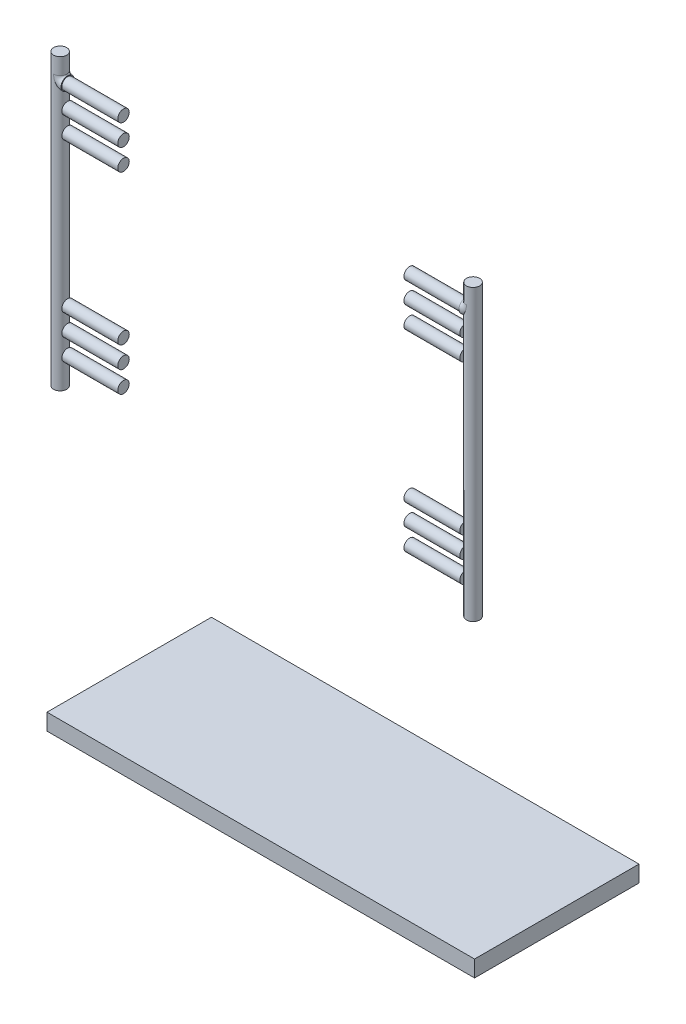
ISO-10303-21;
HEADER;
FILE_DESCRIPTION(('STEP AP214'),'2;1');
FILE_NAME('part.step','',(''),(''),'','','');
FILE_SCHEMA(('AUTOMOTIVE_DESIGN { 1 0 10303 214 1 1 1 1 }'));
ENDSEC;
DATA;
#1=APPLICATION_CONTEXT('core data for automotive mechanical design processes');
#2=APPLICATION_PROTOCOL_DEFINITION('international standard','automotive_design',2000,#1);
#3=PRODUCT_CONTEXT('',#1,'mechanical');
#4=PRODUCT('Part','Part','',(#3));
#5=PRODUCT_RELATED_PRODUCT_CATEGORY('part','',(#4));
#6=PRODUCT_DEFINITION_FORMATION('','',#4);
#7=PRODUCT_DEFINITION_CONTEXT('part definition',#1,'design');
#8=PRODUCT_DEFINITION('design','',#6,#7);
#9=PRODUCT_DEFINITION_SHAPE('','',#8);
#10=(LENGTH_UNIT() NAMED_UNIT(*) SI_UNIT(.MILLI.,.METRE.));
#11=(NAMED_UNIT(*) PLANE_ANGLE_UNIT() SI_UNIT($,.RADIAN.));
#12=(NAMED_UNIT(*) SI_UNIT($,.STERADIAN.) SOLID_ANGLE_UNIT());
#13=UNCERTAINTY_MEASURE_WITH_UNIT(LENGTH_MEASURE(1.E-05),#10,'distance_accuracy_value','');
#14=(GEOMETRIC_REPRESENTATION_CONTEXT(3) GLOBAL_UNCERTAINTY_ASSIGNED_CONTEXT((#13)) GLOBAL_UNIT_ASSIGNED_CONTEXT((#10,
#11,#12)) REPRESENTATION_CONTEXT('',''));
#15=CARTESIAN_POINT('',(0.,0.,0.));
#16=DIRECTION('',(0.,0.,1.));
#17=DIRECTION('',(1.,0.,0.));
#18=AXIS2_PLACEMENT_3D('',#15,#16,#17);
#19=CARTESIAN_POINT('',(-212.622773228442,-1002.37722677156,20.));
#20=DIRECTION('',(1.,0.,0.));
#21=DIRECTION('',(0.,1.,0.));
#22=AXIS2_PLACEMENT_3D('',#19,#20,#21);
#23=PLANE('',#22);
#24=DIRECTION('',(0.,0.,-1.));
#25=VECTOR('',#24,1.);
#26=CARTESIAN_POINT('',(-212.622773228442,-952.377226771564,20.));
#27=LINE('',#26,#25);
#28=CARTESIAN_POINT('',(-212.622773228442,-952.377226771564,20.));
#29=VERTEX_POINT('',#28);
#30=CARTESIAN_POINT('',(-212.622773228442,-952.377226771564,-480.));
#31=VERTEX_POINT('',#30);
#32=EDGE_CURVE('E107',#29,#31,#27,.T.);
#33=ORIENTED_EDGE('',*,*,#32,.T.);
#34=DIRECTION('',(0.,1.,0.));
#35=VECTOR('',#34,1.);
#36=CARTESIAN_POINT('',(-212.622773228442,-1002.37722677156,-480.));
#37=LINE('',#36,#35);
#38=CARTESIAN_POINT('',(-212.622773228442,-1002.37722677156,-480.));
#39=VERTEX_POINT('',#38);
#40=EDGE_CURVE('E12',#39,#31,#37,.T.);
#41=ORIENTED_EDGE('',*,*,#40,.F.);
#42=DIRECTION('',(0.,0.,-1.));
#43=VECTOR('',#42,1.);
#44=CARTESIAN_POINT('',(-212.622773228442,-1002.37722677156,20.));
#45=LINE('',#44,#43);
#46=CARTESIAN_POINT('',(-212.622773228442,-1002.37722677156,20.));
#47=VERTEX_POINT('',#46);
#48=EDGE_CURVE('E95',#47,#39,#45,.T.);
#49=ORIENTED_EDGE('',*,*,#48,.F.);
#50=DIRECTION('',(0.,1.,0.));
#51=VECTOR('',#50,1.);
#52=CARTESIAN_POINT('',(-212.622773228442,-1002.37722677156,20.));
#53=LINE('',#52,#51);
#54=EDGE_CURVE('E103',#47,#29,#53,.T.);
#55=ORIENTED_EDGE('',*,*,#54,.T.);
#56=EDGE_LOOP('',(#33,#41,#49,#55));
#57=FACE_BOUND('',#56,.T.);
#58=ADVANCED_FACE('F44',(#57),#23,.F.);
#59=CARTESIAN_POINT('',(-212.622773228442,-1002.37722677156,-480.));
#60=DIRECTION('',(0.,0.,1.));
#61=DIRECTION('',(1.,0.,0.));
#62=AXIS2_PLACEMENT_3D('',#59,#60,#61);
#63=PLANE('',#62);
#64=DIRECTION('',(1.,0.,0.));
#65=VECTOR('',#64,1.);
#66=CARTESIAN_POINT('',(-212.622773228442,-952.377226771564,-480.));
#67=LINE('',#66,#65);
#68=CARTESIAN_POINT('',(1087.37722677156,-952.377226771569,-480.));
#69=VERTEX_POINT('',#68);
#70=EDGE_CURVE('E99',#31,#69,#67,.T.);
#71=ORIENTED_EDGE('',*,*,#70,.T.);
#72=DIRECTION('',(0.,1.,0.));
#73=VECTOR('',#72,1.);
#74=CARTESIAN_POINT('',(1087.37722677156,-1002.37722677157,-480.));
#75=LINE('',#74,#73);
#76=CARTESIAN_POINT('',(1087.37722677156,-1002.37722677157,-480.));
#77=VERTEX_POINT('',#76);
#78=EDGE_CURVE('E52',#77,#69,#75,.T.);
#79=ORIENTED_EDGE('',*,*,#78,.F.);
#80=DIRECTION('',(1.,0.,0.));
#81=VECTOR('',#80,1.);
#82=CARTESIAN_POINT('',(-212.622773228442,-1002.37722677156,-480.));
#83=LINE('',#82,#81);
#84=EDGE_CURVE('E90',#39,#77,#83,.T.);
#85=ORIENTED_EDGE('',*,*,#84,.F.);
#86=ORIENTED_EDGE('',*,*,#40,.T.);
#87=EDGE_LOOP('',(#71,#79,#85,#86));
#88=FACE_BOUND('',#87,.T.);
#89=ADVANCED_FACE('F98',(#88),#63,.F.);
#90=CARTESIAN_POINT('',(1087.37722677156,-1002.37722677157,20.));
#91=DIRECTION('',(-1.,0.,0.));
#92=DIRECTION('',(0.,-1.,0.));
#93=AXIS2_PLACEMENT_3D('',#90,#91,#92);
#94=PLANE('',#93);
#95=DIRECTION('',(0.,0.,1.));
#96=VECTOR('',#95,1.);
#97=CARTESIAN_POINT('',(1087.37722677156,-952.377226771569,20.));
#98=LINE('',#97,#96);
#99=CARTESIAN_POINT('',(1087.37722677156,-952.377226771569,20.));
#100=VERTEX_POINT('',#99);
#101=EDGE_CURVE('E77',#69,#100,#98,.T.);
#102=ORIENTED_EDGE('',*,*,#101,.T.);
#103=DIRECTION('',(0.,1.,0.));
#104=VECTOR('',#103,1.);
#105=CARTESIAN_POINT('',(1087.37722677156,-1002.37722677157,20.));
#106=LINE('',#105,#104);
#107=CARTESIAN_POINT('',(1087.37722677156,-1002.37722677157,20.));
#108=VERTEX_POINT('',#107);
#109=EDGE_CURVE('E100',#108,#100,#106,.T.);
#110=ORIENTED_EDGE('',*,*,#109,.F.);
#111=DIRECTION('',(0.,0.,1.));
#112=VECTOR('',#111,1.);
#113=CARTESIAN_POINT('',(1087.37722677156,-1002.37722677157,20.));
#114=LINE('',#113,#112);
#115=EDGE_CURVE('E93',#77,#108,#114,.T.);
#116=ORIENTED_EDGE('',*,*,#115,.F.);
#117=ORIENTED_EDGE('',*,*,#78,.T.);
#118=EDGE_LOOP('',(#102,#110,#116,#117));
#119=FACE_BOUND('',#118,.T.);
#120=ADVANCED_FACE('F101',(#119),#94,.F.);
#121=CARTESIAN_POINT('',(-212.622773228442,-1002.37722677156,20.));
#122=DIRECTION('',(0.,0.,-1.));
#123=DIRECTION('',(-1.,0.,0.));
#124=AXIS2_PLACEMENT_3D('',#121,#122,#123);
#125=PLANE('',#124);
#126=DIRECTION('',(-1.,0.,0.));
#127=VECTOR('',#126,1.);
#128=CARTESIAN_POINT('',(-212.622773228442,-952.377226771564,20.));
#129=LINE('',#128,#127);
#130=EDGE_CURVE('E83',#100,#29,#129,.T.);
#131=ORIENTED_EDGE('',*,*,#130,.T.);
#132=ORIENTED_EDGE('',*,*,#54,.F.);
#133=DIRECTION('',(-1.,0.,0.));
#134=VECTOR('',#133,1.);
#135=CARTESIAN_POINT('',(-212.622773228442,-1002.37722677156,20.));
#136=LINE('',#135,#134);
#137=EDGE_CURVE('E60',#108,#47,#136,.T.);
#138=ORIENTED_EDGE('',*,*,#137,.F.);
#139=ORIENTED_EDGE('',*,*,#109,.T.);
#140=EDGE_LOOP('',(#131,#132,#138,#139));
#141=FACE_BOUND('',#140,.T.);
#142=ADVANCED_FACE('F114',(#141),#125,.F.);
#143=CARTESIAN_POINT('',(-3.49971820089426E-12,-1002.37722677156,0.));
#144=DIRECTION('',(0.,-1.,0.));
#145=DIRECTION('',(1.,0.,0.));
#146=AXIS2_PLACEMENT_3D('',#143,#144,#145);
#147=PLANE('',#146);
#148=ORIENTED_EDGE('',*,*,#48,.T.);
#149=ORIENTED_EDGE('',*,*,#84,.T.);
#150=ORIENTED_EDGE('',*,*,#115,.T.);
#151=ORIENTED_EDGE('',*,*,#137,.T.);
#152=EDGE_LOOP('',(#148,#149,#150,#151));
#153=FACE_BOUND('',#152,.T.);
#154=ADVANCED_FACE('F91',(#153),#147,.T.);
#155=CARTESIAN_POINT('',(-3.32514413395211E-12,-952.377226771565,0.));
#156=DIRECTION('',(0.,-1.,0.));
#157=DIRECTION('',(1.,0.,0.));
#158=AXIS2_PLACEMENT_3D('',#155,#156,#157);
#159=PLANE('',#158);
#160=ORIENTED_EDGE('',*,*,#32,.F.);
#161=ORIENTED_EDGE('',*,*,#130,.F.);
#162=ORIENTED_EDGE('',*,*,#101,.F.);
#163=ORIENTED_EDGE('',*,*,#70,.F.);
#164=EDGE_LOOP('',(#160,#161,#162,#163));
#165=FACE_BOUND('',#164,.T.);
#166=ADVANCED_FACE('F117',(#165),#159,.F.);
#167=CLOSED_SHELL('',(#58,#89,#120,#142,#154,#166));
#168=MANIFOLD_SOLID_BREP('B2',#167);
#169=CARTESIAN_POINT('',(1040.,735.,0.));
#170=DIRECTION('',(-1.,0.,0.));
#171=DIRECTION('',(0.,0.,1.));
#172=AXIS2_PLACEMENT_3D('',#169,#170,#171);
#173=CYLINDRICAL_SURFACE('',#172,17.5);
#174=CARTESIAN_POINT('',(1040.,735.,0.));
#175=DIRECTION('',(1.,0.,0.));
#176=DIRECTION('',(0.,0.,-1.));
#177=AXIS2_PLACEMENT_3D('',#174,#175,#176);
#178=CIRCLE('',#177,17.5);
#179=CARTESIAN_POINT('',(1040.,735.,-17.5));
#180=VERTEX_POINT('',#179);
#181=EDGE_CURVE('E42',#180,#180,#178,.T.);
#182=ORIENTED_EDGE('',*,*,#181,.F.);
#183=EDGE_LOOP('',(#182));
#184=FACE_BOUND('',#183,.T.);
#185=CARTESIAN_POINT('',(870.,735.,0.));
#186=DIRECTION('',(1.,0.,0.));
#187=DIRECTION('',(0.,0.,-1.));
#188=AXIS2_PLACEMENT_3D('',#185,#186,#187);
#189=CIRCLE('',#188,17.5);
#190=CARTESIAN_POINT('',(870.,735.,-17.5));
#191=VERTEX_POINT('',#190);
#192=EDGE_CURVE('E178',#191,#191,#189,.T.);
#193=ORIENTED_EDGE('',*,*,#192,.T.);
#194=EDGE_LOOP('',(#193));
#195=FACE_BOUND('',#194,.T.);
#196=ADVANCED_FACE('F175',(#184,#195),#173,.T.);
#197=CARTESIAN_POINT('',(870.,735.,0.));
#198=DIRECTION('',(1.,0.,0.));
#199=DIRECTION('',(0.,0.,-1.));
#200=AXIS2_PLACEMENT_3D('',#197,#198,#199);
#201=PLANE('',#200);
#202=ORIENTED_EDGE('',*,*,#192,.F.);
#203=EDGE_LOOP('',(#202));
#204=FACE_BOUND('',#203,.T.);
#205=ADVANCED_FACE('F220',(#204),#201,.F.);
#206=CARTESIAN_POINT('',(1040.,735.,0.));
#207=DIRECTION('',(1.,0.,0.));
#208=DIRECTION('',(0.,0.,-1.));
#209=AXIS2_PLACEMENT_3D('',#206,#207,#208);
#210=PLANE('',#209);
#211=CARTESIAN_POINT('',(1040.,735.,0.));
#212=DIRECTION('',(1.,0.,0.));
#213=DIRECTION('',(0.,0.,-1.));
#214=AXIS2_PLACEMENT_3D('',#211,#212,#213);
#215=CIRCLE('',#214,20.);
#216=CARTESIAN_POINT('',(1040.,735.,-20.));
#217=VERTEX_POINT('',#216);
#218=EDGE_CURVE('E194',#217,#217,#215,.T.);
#219=ORIENTED_EDGE('',*,*,#218,.F.);
#220=EDGE_LOOP('',(#219));
#221=FACE_BOUND('',#220,.T.);
#222=ORIENTED_EDGE('',*,*,#181,.T.);
#223=EDGE_LOOP('',(#222));
#224=FACE_BOUND('',#223,.T.);
#225=ADVANCED_FACE('F218',(#221,#224),#210,.F.);
#226=CARTESIAN_POINT('',(1040.,757.755617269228,0.));
#227=DIRECTION('',(0.,0.,-1.));
#228=DIRECTION('',(-1.,0.,0.));
#229=AXIS2_PLACEMENT_3D('',#226,#227,#228);
#230=TOROIDAL_SURFACE('',#229,22.755617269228,20.);
#231=CARTESIAN_POINT('',(1062.75561726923,757.755617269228,0.));
#232=DIRECTION('',(0.,1.,0.));
#233=DIRECTION('',(0.,0.,-1.));
#234=AXIS2_PLACEMENT_3D('',#231,#232,#233);
#235=CIRCLE('',#234,20.);
#236=CARTESIAN_POINT('',(1062.75561726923,757.755617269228,-20.));
#237=VERTEX_POINT('',#236);
#238=CARTESIAN_POINT('',(1062.75561726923,757.755617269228,20.));
#239=VERTEX_POINT('',#238);
#240=EDGE_CURVE('E188',#237,#239,#235,.T.);
#241=ORIENTED_EDGE('',*,*,#240,.F.);
#242=CARTESIAN_POINT('',(1062.75561726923,757.755617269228,-20.));
#243=CARTESIAN_POINT('',(1062.75561726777,757.684505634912,-20.0000000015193));
#244=CARTESIAN_POINT('',(1062.75545059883,757.613394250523,-20.0000000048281));
#245=CARTESIAN_POINT('',(1062.75479714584,757.473989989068,-19.9999999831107));
#246=CARTESIAN_POINT('',(1062.75432330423,757.405697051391,-19.9999999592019));
#247=CARTESIAN_POINT('',(1062.75118544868,757.064227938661,-19.999999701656));
#248=CARTESIAN_POINT('',(1062.74621559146,756.791069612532,-19.999999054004));
#249=CARTESIAN_POINT('',(1062.72959863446,756.180028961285,-19.9999853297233));
#250=CARTESIAN_POINT('',(1062.71664609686,755.842181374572,-19.9999693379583));
#251=CARTESIAN_POINT('',(1062.6854365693,755.211194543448,-19.9998818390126));
#252=CARTESIAN_POINT('',(1062.66809915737,754.918008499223,-19.9998178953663));
#253=CARTESIAN_POINT('',(1062.60760267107,754.038569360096,-19.9994945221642));
#254=CARTESIAN_POINT('',(1062.55597239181,753.452866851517,-19.9991034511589));
#255=CARTESIAN_POINT('',(1062.46182209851,752.57609414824,-19.9978659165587));
#256=CARTESIAN_POINT('',(1062.42764886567,752.284094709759,-19.9973448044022));
#257=CARTESIAN_POINT('',(1062.35378106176,751.700768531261,-19.9959969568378));
#258=CARTESIAN_POINT('',(1062.31408601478,751.409441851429,-19.995170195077));
#259=CARTESIAN_POINT('',(1062.18584859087,750.530114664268,-19.992067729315));
#260=CARTESIAN_POINT('',(1062.08885883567,749.943326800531,-19.9891748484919));
#261=CARTESIAN_POINT('',(1061.87306681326,748.773746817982,-19.9808094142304));
#262=CARTESIAN_POINT('',(1061.75426202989,748.190955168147,-19.9753365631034));
#263=CARTESIAN_POINT('',(1061.49544481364,747.029895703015,-19.9606809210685));
#264=CARTESIAN_POINT('',(1061.35542396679,746.451629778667,-19.9514966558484));
#265=CARTESIAN_POINT('',(1061.05495946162,745.300517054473,-19.9281312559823));
#266=CARTESIAN_POINT('',(1060.89451422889,744.727670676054,-19.9139497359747));
#267=CARTESIAN_POINT('',(1060.38272557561,743.014788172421,-19.86171258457));
#268=CARTESIAN_POINT('',(1060.00168183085,741.883753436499,-19.8139906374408));
#269=CARTESIAN_POINT('',(1059.16822762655,739.650928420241,-19.680155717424));
#270=CARTESIAN_POINT('',(1058.7158286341,738.549133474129,-19.5940489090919));
#271=CARTESIAN_POINT('',(1057.74612326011,736.374219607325,-19.3688884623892));
#272=CARTESIAN_POINT('',(1057.22854547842,735.301244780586,-19.2296081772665));
#273=CARTESIAN_POINT('',(1056.13976009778,733.19341021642,-18.8827162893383));
#274=CARTESIAN_POINT('',(1055.56853716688,732.158561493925,-18.6750851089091));
#275=CARTESIAN_POINT('',(1054.68181975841,730.641931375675,-18.3007141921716));
#276=CARTESIAN_POINT('',(1054.38177136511,730.143099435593,-18.165702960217));
#277=CARTESIAN_POINT('',(1053.77310881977,729.157491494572,-17.8725678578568));
#278=CARTESIAN_POINT('',(1053.46449423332,728.670716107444,-17.7144428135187));
#279=CARTESIAN_POINT('',(1052.84090202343,727.710782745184,-17.3731016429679));
#280=CARTESIAN_POINT('',(1052.52592965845,727.237614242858,-17.1899055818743));
#281=CARTESIAN_POINT('',(1051.89157684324,726.305834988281,-16.7961891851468));
#282=CARTESIAN_POINT('',(1051.57219671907,725.847223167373,-16.5856708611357));
#283=CARTESIAN_POINT('',(1050.90950237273,724.915178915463,-16.1196990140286));
#284=CARTESIAN_POINT('',(1050.56604801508,724.442884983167,-15.8621546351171));
#285=CARTESIAN_POINT('',(1049.88038487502,723.518958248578,-15.3108419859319));
#286=CARTESIAN_POINT('',(1049.53817599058,723.067323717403,-15.0170767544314));
#287=CARTESIAN_POINT('',(1048.85914230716,722.187585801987,-14.3910096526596));
#288=CARTESIAN_POINT('',(1048.52231531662,721.759472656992,-14.0587239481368));
#289=CARTESIAN_POINT('',(1047.85859760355,720.92987233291,-13.3533967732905));
#290=CARTESIAN_POINT('',(1047.53170525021,720.528380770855,-12.9803620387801));
#291=CARTESIAN_POINT('',(1046.95019093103,719.824762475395,-12.2622277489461));
#292=CARTESIAN_POINT('',(1046.69307381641,719.517681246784,-11.9240028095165));
#293=CARTESIAN_POINT('',(1046.19256995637,718.926545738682,-11.2184004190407));
#294=CARTESIAN_POINT('',(1045.94918287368,718.642490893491,-10.8510236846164));
#295=CARTESIAN_POINT('',(1045.48011641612,718.100451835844,-10.0874979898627));
#296=CARTESIAN_POINT('',(1045.25441976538,717.842442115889,-9.69137784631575));
#297=CARTESIAN_POINT('',(1044.82452124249,717.355221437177,-8.8707495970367));
#298=CARTESIAN_POINT('',(1044.62031483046,717.126004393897,-8.44624751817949));
#299=CARTESIAN_POINT('',(1044.27457831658,716.740749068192,-7.65505794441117));
#300=CARTESIAN_POINT('',(1044.12856067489,716.579127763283,-7.29304093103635));
#301=CARTESIAN_POINT('',(1043.85548176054,716.278399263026,-6.55289178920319));
#302=CARTESIAN_POINT('',(1043.72841667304,716.139287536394,-6.17476292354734));
#303=CARTESIAN_POINT('',(1043.49539853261,715.885236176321,-5.40424916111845));
#304=CARTESIAN_POINT('',(1043.3894391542,715.770289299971,-5.01186857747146));
#305=CARTESIAN_POINT('',(1043.20053820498,715.566021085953,-4.21503445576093));
#306=CARTESIAN_POINT('',(1043.1175969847,715.476700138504,-3.81058073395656));
#307=CARTESIAN_POINT('',(1042.97601728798,715.324568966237,-2.99024400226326));
#308=CARTESIAN_POINT('',(1042.91750864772,715.261900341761,-2.574312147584));
#309=CARTESIAN_POINT('',(1042.82667365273,715.164725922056,-1.73632078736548));
#310=CARTESIAN_POINT('',(1042.79434742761,715.130220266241,-1.31426125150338));
#311=CARTESIAN_POINT('',(1042.75659708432,715.089933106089,-0.467653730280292));
#312=CARTESIAN_POINT('',(1042.75116763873,715.084145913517,-0.0431062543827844));
#313=CARTESIAN_POINT('',(1042.76732109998,715.101377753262,0.80486960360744));
#314=CARTESIAN_POINT('',(1042.78890232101,715.124394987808,1.22829805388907));
#315=CARTESIAN_POINT('',(1042.85560248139,715.195664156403,2.03439294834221));
#316=CARTESIAN_POINT('',(1042.8985514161,715.24159051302,2.41744944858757));
#317=CARTESIAN_POINT('',(1043.00583840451,715.356596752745,3.17699882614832));
#318=CARTESIAN_POINT('',(1043.07017496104,715.425675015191,3.55349216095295));
#319=CARTESIAN_POINT('',(1043.21911936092,715.586117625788,4.29758455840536));
#320=CARTESIAN_POINT('',(1043.30372699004,715.677481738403,4.66518371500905));
#321=CARTESIAN_POINT('',(1043.49183206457,715.881428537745,5.38949041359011));
#322=CARTESIAN_POINT('',(1043.59533048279,715.99401231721,5.74619739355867));
#323=CARTESIAN_POINT('',(1043.82428192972,716.244255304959,6.46152783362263));
#324=CARTESIAN_POINT('',(1043.95046542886,716.382758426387,6.81962143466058));
#325=CARTESIAN_POINT('',(1044.21970422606,716.679996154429,7.52070190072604));
#326=CARTESIAN_POINT('',(1044.36275947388,716.838730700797,7.86368881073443));
#327=CARTESIAN_POINT('',(1044.66383931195,717.174999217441,8.53360834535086));
#328=CARTESIAN_POINT('',(1044.82186828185,717.352538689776,8.86053623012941));
#329=CARTESIAN_POINT('',(1045.15094218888,717.724932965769,9.49757954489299));
#330=CARTESIAN_POINT('',(1045.32198988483,717.919791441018,9.80769138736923));
#331=CARTESIAN_POINT('',(1045.76274335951,718.425918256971,10.5600749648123));
#332=CARTESIAN_POINT('',(1046.03935260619,718.747041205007,10.9917279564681));
#333=CARTESIAN_POINT('',(1046.61165014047,719.420551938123,11.8162786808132));
#334=CARTESIAN_POINT('',(1046.90734582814,719.772951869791,12.2091612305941));
#335=CARTESIAN_POINT('',(1047.51305008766,720.505777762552,12.9574784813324));
#336=CARTESIAN_POINT('',(1047.82308289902,720.88625188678,13.3128461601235));
#337=CARTESIAN_POINT('',(1048.45230437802,721.671312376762,13.9867002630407));
#338=CARTESIAN_POINT('',(1048.77149310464,722.075898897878,14.3051864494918));
#339=CARTESIAN_POINT('',(1049.55871963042,723.091881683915,15.041547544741));
#340=CARTESIAN_POINT('',(1050.02959463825,723.714970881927,15.44031936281));
#341=CARTESIAN_POINT('',(1050.9718389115,724.998919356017,16.1709073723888));
#342=CARTESIAN_POINT('',(1051.44320830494,725.659796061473,16.5026923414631));
#343=CARTESIAN_POINT('',(1052.37855196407,727.014673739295,17.106334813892));
#344=CARTESIAN_POINT('',(1052.84251549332,727.708717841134,17.3781115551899));
#345=CARTESIAN_POINT('',(1053.75537949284,729.124771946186,17.8679603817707));
#346=CARTESIAN_POINT('',(1054.20428150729,729.846779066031,18.0860379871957));
#347=CARTESIAN_POINT('',(1055.15445005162,731.438111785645,18.5077192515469));
#348=CARTESIAN_POINT('',(1055.65196070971,732.311921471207,18.7028405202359));
#349=CARTESIAN_POINT('',(1056.61088753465,734.089215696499,19.0394469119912));
#350=CARTESIAN_POINT('',(1057.07229646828,734.992706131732,19.1809213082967));
#351=CARTESIAN_POINT('',(1057.95184327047,736.825021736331,19.4198668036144));
#352=CARTESIAN_POINT('',(1058.37002275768,737.753821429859,19.5173805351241));
#353=CARTESIAN_POINT('',(1059.15767649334,739.634425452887,19.6778125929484));
#354=CARTESIAN_POINT('',(1059.5271625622,740.586224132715,19.740739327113));
#355=CARTESIAN_POINT('',(1060.23325112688,742.569003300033,19.8437086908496));
#356=CARTESIAN_POINT('',(1060.56648230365,743.601276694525,19.8821249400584));
#357=CARTESIAN_POINT('',(1061.01669582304,745.163859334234,19.9248267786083));
#358=CARTESIAN_POINT('',(1061.15846617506,745.686952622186,19.9365725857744));
#359=CARTESIAN_POINT('',(1061.42493497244,746.737548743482,19.9561309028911));
#360=CARTESIAN_POINT('',(1061.54963381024,747.265051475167,19.9639435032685));
#361=CARTESIAN_POINT('',(1061.80864528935,748.448453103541,19.9780837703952));
#362=CARTESIAN_POINT('',(1061.93832557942,749.105381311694,19.983630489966));
#363=CARTESIAN_POINT('',(1062.16986331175,750.424071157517,19.991755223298));
#364=CARTESIAN_POINT('',(1062.27172286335,751.085832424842,19.9943334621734));
#365=CARTESIAN_POINT('',(1062.46850153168,752.576977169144,19.998241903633));
#366=CARTESIAN_POINT('',(1062.55550579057,753.407428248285,19.9991071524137));
#367=CARTESIAN_POINT('',(1062.65891569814,754.74587119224,19.9998014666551));
#368=CARTESIAN_POINT('',(1062.68962550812,755.252801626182,19.9999036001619));
#369=CARTESIAN_POINT('',(1062.72493889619,756.058185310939,19.999980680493));
#370=CARTESIAN_POINT('',(1062.73508574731,756.35640010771,19.9999907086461));
#371=CARTESIAN_POINT('',(1062.7494571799,756.950502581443,20.0000003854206));
#372=CARTESIAN_POINT('',(1062.75373016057,757.246389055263,20.0000001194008));
#373=CARTESIAN_POINT('',(1062.75545062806,757.613394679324,19.9999999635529));
#374=CARTESIAN_POINT('',(1062.7556173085,757.684506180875,19.999999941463));
#375=CARTESIAN_POINT('',(1062.75561726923,757.755617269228,20.));
#376=B_SPLINE_CURVE_WITH_KNOTS('',3,(#242,#243,#244,#245,#246,#247,#248,#249,#250,#251,#252,
#253,#254,#255,#256,#257,#258,#259,#260,#261,#262,#263,#264,#265,#266,#267,#268,#269,#270,#271,
#272,#273,#274,#275,#276,#277,#278,#279,#280,#281,#282,#283,#284,#285,#286,#287,#288,#289,#290,
#291,#292,#293,#294,#295,#296,#297,#298,#299,#300,#301,#302,#303,#304,#305,#306,#307,#308,#309,
#310,#311,#312,#313,#314,#315,#316,#317,#318,#319,#320,#321,#322,#323,#324,#325,#326,#327,#328,
#329,#330,#331,#332,#333,#334,#335,#336,#337,#338,#339,#340,#341,#342,#343,#344,#345,#346,#347,
#348,#349,#350,#351,#352,#353,#354,#355,#356,#357,#358,#359,#360,#361,#362,#363,#364,#365,#366,
#367,#368,#369,#370,#371,#372,#373,#374,#375),.UNSPECIFIED.,.F.,.F.,(4,2,2,2,2,2,2,2,2,2,2,2,2,
2,2,2,2,2,2,2,2,2,2,2,2,2,2,2,2,2,2,2,2,2,2,2,2,2,2,2,2,2,2,2,2,2,2,2,2,2,2,2,2,2,2,2,2,2,2,2,2,
2,2,2,2,2,4),(0.,0.213334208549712,0.418217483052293,1.23778170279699,2.25197794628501,
3.13303285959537,4.89643724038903,5.77837403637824,6.66038689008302,8.44419231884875,
10.228203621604,12.0129242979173,13.7977826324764,17.3777604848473,20.9571636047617,
24.5519970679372,28.1478610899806,29.9400587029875,31.7323473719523,33.5232099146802,
35.3139406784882,37.2274032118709,39.1407053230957,41.0532073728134,42.9653937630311,
44.5367037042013,46.1079750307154,47.6776922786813,49.2470772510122,50.5133280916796,
51.7793237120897,53.0449393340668,54.3105742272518,55.5828517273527,56.8551355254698,
58.1271673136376,59.3991197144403,60.5623311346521,61.7254611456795,62.8885788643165,
64.0517564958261,65.2629977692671,66.4742354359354,67.6858284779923,68.8976789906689,
70.7097608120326,72.5225494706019,74.3385238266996,76.1545098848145,78.7811966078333,
81.4091048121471,84.040528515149,86.671681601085,89.7417329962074,92.8123979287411,
95.8800785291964,98.9470130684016,102.200659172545,103.826686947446,105.452677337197,
107.460944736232,109.4690598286,111.972695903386,113.496012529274,114.391121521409,
115.278809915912,115.492144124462),.UNSPECIFIED.);
#377=EDGE_CURVE('E190',#237,#239,#376,.T.);
#378=ORIENTED_EDGE('',*,*,#377,.T.);
#379=EDGE_LOOP('',(#241,#378));
#380=FACE_BOUND('',#379,.T.);
#381=ORIENTED_EDGE('',*,*,#218,.T.);
#382=EDGE_LOOP('',(#381));
#383=FACE_BOUND('',#382,.T.);
#384=ADVANCED_FACE('F191',(#380,#383),#230,.T.);
#385=CARTESIAN_POINT('',(1062.75561726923,-72.2443827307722,0.));
#386=DIRECTION('',(0.,1.,0.));
#387=DIRECTION('',(-1.,0.,0.));
#388=AXIS2_PLACEMENT_3D('',#385,#386,#387);
#389=CYLINDRICAL_SURFACE('',#388,20.);
#390=CARTESIAN_POINT('',(1062.75561726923,-72.2443827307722,0.));
#391=DIRECTION('',(0.,1.,0.));
#392=DIRECTION('',(-1.,0.,0.));
#393=AXIS2_PLACEMENT_3D('',#390,#391,#392);
#394=CIRCLE('',#393,20.);
#395=CARTESIAN_POINT('',(1042.75561726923,-72.2443827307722,0.));
#396=VERTEX_POINT('',#395);
#397=EDGE_CURVE('E195',#396,#396,#394,.T.);
#398=ORIENTED_EDGE('',*,*,#397,.T.);
#399=EDGE_LOOP('',(#398));
#400=FACE_BOUND('',#399,.T.);
#401=ORIENTED_EDGE('',*,*,#377,.F.);
#402=ORIENTED_EDGE('',*,*,#240,.T.);
#403=EDGE_LOOP('',(#401,#402));
#404=FACE_BOUND('',#403,.T.);
#405=CARTESIAN_POINT('',(1062.75561726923,807.755617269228,0.));
#406=DIRECTION('',(0.,1.,0.));
#407=DIRECTION('',(-1.,0.,0.));
#408=AXIS2_PLACEMENT_3D('',#405,#406,#407);
#409=CIRCLE('',#408,20.);
#410=CARTESIAN_POINT('',(1042.75561726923,807.755617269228,0.));
#411=VERTEX_POINT('',#410);
#412=EDGE_CURVE('E279',#411,#411,#409,.T.);
#413=ORIENTED_EDGE('',*,*,#412,.F.);
#414=EDGE_LOOP('',(#413));
#415=FACE_BOUND('',#414,.T.);
#416=ADVANCED_FACE('F197',(#400,#404,#415),#389,.T.);
#417=CARTESIAN_POINT('',(1062.75561726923,-72.2443827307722,0.));
#418=DIRECTION('',(0.,1.,0.));
#419=DIRECTION('',(-1.,0.,0.));
#420=AXIS2_PLACEMENT_3D('',#417,#418,#419);
#421=PLANE('',#420);
#422=ORIENTED_EDGE('',*,*,#397,.F.);
#423=EDGE_LOOP('',(#422));
#424=FACE_BOUND('',#423,.T.);
#425=ADVANCED_FACE('F215',(#424),#421,.F.);
#426=CARTESIAN_POINT('',(1062.75561726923,807.755617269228,0.));
#427=DIRECTION('',(0.,1.,0.));
#428=DIRECTION('',(-1.,0.,0.));
#429=AXIS2_PLACEMENT_3D('',#426,#427,#428);
#430=PLANE('',#429);
#431=ORIENTED_EDGE('',*,*,#412,.T.);
#432=EDGE_LOOP('',(#431));
#433=FACE_BOUND('',#432,.T.);
#434=ADVANCED_FACE('F265',(#433),#430,.T.);
#435=CLOSED_SHELL('',(#196,#205,#225,#384,#416,#425,#434));
#436=MANIFOLD_SOLID_BREP('B6',#435);
#437=CARTESIAN_POINT('',(1040.,670.,0.));
#438=DIRECTION('',(-1.,0.,0.));
#439=DIRECTION('',(0.,0.,1.));
#440=AXIS2_PLACEMENT_3D('',#437,#438,#439);
#441=CYLINDRICAL_SURFACE('',#440,17.5);
#442=CARTESIAN_POINT('',(1040.,670.,0.));
#443=DIRECTION('',(1.,0.,0.));
#444=DIRECTION('',(0.,0.,-1.));
#445=AXIS2_PLACEMENT_3D('',#442,#443,#444);
#446=CIRCLE('',#445,17.5);
#447=CARTESIAN_POINT('',(1040.,670.,-17.5));
#448=VERTEX_POINT('',#447);
#449=EDGE_CURVE('E174',#448,#448,#446,.T.);
#450=ORIENTED_EDGE('',*,*,#449,.F.);
#451=EDGE_LOOP('',(#450));
#452=FACE_BOUND('',#451,.T.);
#453=CARTESIAN_POINT('',(870.,670.,0.));
#454=DIRECTION('',(1.,0.,0.));
#455=DIRECTION('',(0.,0.,-1.));
#456=AXIS2_PLACEMENT_3D('',#453,#454,#455);
#457=CIRCLE('',#456,17.5);
#458=CARTESIAN_POINT('',(870.,670.,-17.5));
#459=VERTEX_POINT('',#458);
#460=EDGE_CURVE('E297',#459,#459,#457,.T.);
#461=ORIENTED_EDGE('',*,*,#460,.T.);
#462=EDGE_LOOP('',(#461));
#463=FACE_BOUND('',#462,.T.);
#464=ADVANCED_FACE('F294',(#452,#463),#441,.T.);
#465=CARTESIAN_POINT('',(1040.,670.,0.));
#466=DIRECTION('',(1.,0.,0.));
#467=DIRECTION('',(0.,0.,-1.));
#468=AXIS2_PLACEMENT_3D('',#465,#466,#467);
#469=PLANE('',#468);
#470=ORIENTED_EDGE('',*,*,#449,.T.);
#471=EDGE_LOOP('',(#470));
#472=FACE_BOUND('',#471,.T.);
#473=ADVANCED_FACE('F309',(#472),#469,.T.);
#474=CARTESIAN_POINT('',(870.,670.,0.));
#475=DIRECTION('',(1.,0.,0.));
#476=DIRECTION('',(0.,0.,-1.));
#477=AXIS2_PLACEMENT_3D('',#474,#475,#476);
#478=PLANE('',#477);
#479=ORIENTED_EDGE('',*,*,#460,.F.);
#480=EDGE_LOOP('',(#479));
#481=FACE_BOUND('',#480,.T.);
#482=ADVANCED_FACE('F307',(#481),#478,.F.);
#483=CLOSED_SHELL('',(#464,#473,#482));
#484=MANIFOLD_SOLID_BREP('B36',#483);
#485=CARTESIAN_POINT('',(1040.,605.,0.));
#486=DIRECTION('',(-1.,0.,0.));
#487=DIRECTION('',(0.,0.,1.));
#488=AXIS2_PLACEMENT_3D('',#485,#486,#487);
#489=CYLINDRICAL_SURFACE('',#488,17.5);
#490=CARTESIAN_POINT('',(1040.,605.,0.));
#491=DIRECTION('',(1.,0.,0.));
#492=DIRECTION('',(0.,0.,-1.));
#493=AXIS2_PLACEMENT_3D('',#490,#491,#492);
#494=CIRCLE('',#493,17.5);
#495=CARTESIAN_POINT('',(1040.,605.,-17.5));
#496=VERTEX_POINT('',#495);
#497=EDGE_CURVE('E293',#496,#496,#494,.T.);
#498=ORIENTED_EDGE('',*,*,#497,.F.);
#499=EDGE_LOOP('',(#498));
#500=FACE_BOUND('',#499,.T.);
#501=CARTESIAN_POINT('',(870.,605.,0.));
#502=DIRECTION('',(1.,0.,0.));
#503=DIRECTION('',(0.,0.,-1.));
#504=AXIS2_PLACEMENT_3D('',#501,#502,#503);
#505=CIRCLE('',#504,17.5);
#506=CARTESIAN_POINT('',(870.,605.,-17.5));
#507=VERTEX_POINT('',#506);
#508=EDGE_CURVE('E345',#507,#507,#505,.T.);
#509=ORIENTED_EDGE('',*,*,#508,.T.);
#510=EDGE_LOOP('',(#509));
#511=FACE_BOUND('',#510,.T.);
#512=ADVANCED_FACE('F342',(#500,#511),#489,.T.);
#513=CARTESIAN_POINT('',(1040.,605.,0.));
#514=DIRECTION('',(1.,0.,0.));
#515=DIRECTION('',(0.,0.,-1.));
#516=AXIS2_PLACEMENT_3D('',#513,#514,#515);
#517=PLANE('',#516);
#518=ORIENTED_EDGE('',*,*,#497,.T.);
#519=EDGE_LOOP('',(#518));
#520=FACE_BOUND('',#519,.T.);
#521=ADVANCED_FACE('F357',(#520),#517,.T.);
#522=CARTESIAN_POINT('',(870.,605.,0.));
#523=DIRECTION('',(1.,0.,0.));
#524=DIRECTION('',(0.,0.,-1.));
#525=AXIS2_PLACEMENT_3D('',#522,#523,#524);
#526=PLANE('',#525);
#527=ORIENTED_EDGE('',*,*,#508,.F.);
#528=EDGE_LOOP('',(#527));
#529=FACE_BOUND('',#528,.T.);
#530=ADVANCED_FACE('F355',(#529),#526,.F.);
#531=CLOSED_SHELL('',(#512,#521,#530));
#532=MANIFOLD_SOLID_BREP('B169',#531);
#533=CARTESIAN_POINT('',(1040.,150.,0.));
#534=DIRECTION('',(-1.,0.,0.));
#535=DIRECTION('',(0.,0.,1.));
#536=AXIS2_PLACEMENT_3D('',#533,#534,#535);
#537=CYLINDRICAL_SURFACE('',#536,17.5);
#538=CARTESIAN_POINT('',(1040.,150.,0.));
#539=DIRECTION('',(1.,0.,0.));
#540=DIRECTION('',(0.,0.,-1.));
#541=AXIS2_PLACEMENT_3D('',#538,#539,#540);
#542=CIRCLE('',#541,17.5);
#543=CARTESIAN_POINT('',(1040.,150.,-17.5));
#544=VERTEX_POINT('',#543);
#545=EDGE_CURVE('E341',#544,#544,#542,.T.);
#546=ORIENTED_EDGE('',*,*,#545,.F.);
#547=EDGE_LOOP('',(#546));
#548=FACE_BOUND('',#547,.T.);
#549=CARTESIAN_POINT('',(870.,150.,0.));
#550=DIRECTION('',(1.,0.,0.));
#551=DIRECTION('',(0.,0.,-1.));
#552=AXIS2_PLACEMENT_3D('',#549,#550,#551);
#553=CIRCLE('',#552,17.5);
#554=CARTESIAN_POINT('',(870.,150.,-17.5));
#555=VERTEX_POINT('',#554);
#556=EDGE_CURVE('E393',#555,#555,#553,.T.);
#557=ORIENTED_EDGE('',*,*,#556,.T.);
#558=EDGE_LOOP('',(#557));
#559=FACE_BOUND('',#558,.T.);
#560=ADVANCED_FACE('F390',(#548,#559),#537,.T.);
#561=CARTESIAN_POINT('',(1040.,150.,0.));
#562=DIRECTION('',(1.,0.,0.));
#563=DIRECTION('',(0.,0.,-1.));
#564=AXIS2_PLACEMENT_3D('',#561,#562,#563);
#565=PLANE('',#564);
#566=ORIENTED_EDGE('',*,*,#545,.T.);
#567=EDGE_LOOP('',(#566));
#568=FACE_BOUND('',#567,.T.);
#569=ADVANCED_FACE('F405',(#568),#565,.T.);
#570=CARTESIAN_POINT('',(870.,150.,0.));
#571=DIRECTION('',(1.,0.,0.));
#572=DIRECTION('',(0.,0.,-1.));
#573=AXIS2_PLACEMENT_3D('',#570,#571,#572);
#574=PLANE('',#573);
#575=ORIENTED_EDGE('',*,*,#556,.F.);
#576=EDGE_LOOP('',(#575));
#577=FACE_BOUND('',#576,.T.);
#578=ADVANCED_FACE('F403',(#577),#574,.F.);
#579=CLOSED_SHELL('',(#560,#569,#578));
#580=MANIFOLD_SOLID_BREP('B288',#579);
#581=CARTESIAN_POINT('',(1040.,85.,0.));
#582=DIRECTION('',(-1.,0.,0.));
#583=DIRECTION('',(0.,0.,1.));
#584=AXIS2_PLACEMENT_3D('',#581,#582,#583);
#585=CYLINDRICAL_SURFACE('',#584,17.5);
#586=CARTESIAN_POINT('',(1040.,85.,0.));
#587=DIRECTION('',(1.,0.,0.));
#588=DIRECTION('',(0.,0.,-1.));
#589=AXIS2_PLACEMENT_3D('',#586,#587,#588);
#590=CIRCLE('',#589,17.5);
#591=CARTESIAN_POINT('',(1040.,85.,-17.5));
#592=VERTEX_POINT('',#591);
#593=EDGE_CURVE('E389',#592,#592,#590,.T.);
#594=ORIENTED_EDGE('',*,*,#593,.F.);
#595=EDGE_LOOP('',(#594));
#596=FACE_BOUND('',#595,.T.);
#597=CARTESIAN_POINT('',(870.,85.,0.));
#598=DIRECTION('',(1.,0.,0.));
#599=DIRECTION('',(0.,0.,-1.));
#600=AXIS2_PLACEMENT_3D('',#597,#598,#599);
#601=CIRCLE('',#600,17.5);
#602=CARTESIAN_POINT('',(870.,85.,-17.5));
#603=VERTEX_POINT('',#602);
#604=EDGE_CURVE('E441',#603,#603,#601,.T.);
#605=ORIENTED_EDGE('',*,*,#604,.T.);
#606=EDGE_LOOP('',(#605));
#607=FACE_BOUND('',#606,.T.);
#608=ADVANCED_FACE('F438',(#596,#607),#585,.T.);
#609=CARTESIAN_POINT('',(1040.,85.,0.));
#610=DIRECTION('',(1.,0.,0.));
#611=DIRECTION('',(0.,0.,-1.));
#612=AXIS2_PLACEMENT_3D('',#609,#610,#611);
#613=PLANE('',#612);
#614=ORIENTED_EDGE('',*,*,#593,.T.);
#615=EDGE_LOOP('',(#614));
#616=FACE_BOUND('',#615,.T.);
#617=ADVANCED_FACE('F453',(#616),#613,.T.);
#618=CARTESIAN_POINT('',(870.,85.,0.));
#619=DIRECTION('',(1.,0.,0.));
#620=DIRECTION('',(0.,0.,-1.));
#621=AXIS2_PLACEMENT_3D('',#618,#619,#620);
#622=PLANE('',#621);
#623=ORIENTED_EDGE('',*,*,#604,.F.);
#624=EDGE_LOOP('',(#623));
#625=FACE_BOUND('',#624,.T.);
#626=ADVANCED_FACE('F451',(#625),#622,.F.);
#627=CLOSED_SHELL('',(#608,#617,#626));
#628=MANIFOLD_SOLID_BREP('B336',#627);
#629=CARTESIAN_POINT('',(1040.,20.,0.));
#630=DIRECTION('',(-1.,0.,0.));
#631=DIRECTION('',(0.,0.,1.));
#632=AXIS2_PLACEMENT_3D('',#629,#630,#631);
#633=CYLINDRICAL_SURFACE('',#632,17.5);
#634=CARTESIAN_POINT('',(1040.,20.,0.));
#635=DIRECTION('',(1.,0.,0.));
#636=DIRECTION('',(0.,0.,-1.));
#637=AXIS2_PLACEMENT_3D('',#634,#635,#636);
#638=CIRCLE('',#637,17.5);
#639=CARTESIAN_POINT('',(1040.,20.,-17.5));
#640=VERTEX_POINT('',#639);
#641=EDGE_CURVE('E437',#640,#640,#638,.T.);
#642=ORIENTED_EDGE('',*,*,#641,.F.);
#643=EDGE_LOOP('',(#642));
#644=FACE_BOUND('',#643,.T.);
#645=CARTESIAN_POINT('',(870.,20.,0.));
#646=DIRECTION('',(1.,0.,0.));
#647=DIRECTION('',(0.,0.,-1.));
#648=AXIS2_PLACEMENT_3D('',#645,#646,#647);
#649=CIRCLE('',#648,17.5);
#650=CARTESIAN_POINT('',(870.,20.,-17.5));
#651=VERTEX_POINT('',#650);
#652=EDGE_CURVE('E491',#651,#651,#649,.T.);
#653=ORIENTED_EDGE('',*,*,#652,.T.);
#654=EDGE_LOOP('',(#653));
#655=FACE_BOUND('',#654,.T.);
#656=ADVANCED_FACE('F488',(#644,#655),#633,.T.);
#657=CARTESIAN_POINT('',(1040.,20.,0.));
#658=DIRECTION('',(1.,0.,0.));
#659=DIRECTION('',(0.,0.,-1.));
#660=AXIS2_PLACEMENT_3D('',#657,#658,#659);
#661=PLANE('',#660);
#662=ORIENTED_EDGE('',*,*,#641,.T.);
#663=EDGE_LOOP('',(#662));
#664=FACE_BOUND('',#663,.T.);
#665=ADVANCED_FACE('F503',(#664),#661,.T.);
#666=CARTESIAN_POINT('',(870.,20.,0.));
#667=DIRECTION('',(1.,0.,0.));
#668=DIRECTION('',(0.,0.,-1.));
#669=AXIS2_PLACEMENT_3D('',#666,#667,#668);
#670=PLANE('',#669);
#671=ORIENTED_EDGE('',*,*,#652,.F.);
#672=EDGE_LOOP('',(#671));
#673=FACE_BOUND('',#672,.T.);
#674=ADVANCED_FACE('F501',(#673),#670,.F.);
#675=CLOSED_SHELL('',(#656,#665,#674));
#676=MANIFOLD_SOLID_BREP('B384',#675);
#677=CARTESIAN_POINT('',(-170.,715.,0.));
#678=DIRECTION('',(1.,0.,0.));
#679=DIRECTION('',(0.,0.,-1.));
#680=AXIS2_PLACEMENT_3D('',#677,#678,#679);
#681=CYLINDRICAL_SURFACE('',#680,17.5);
#682=CARTESIAN_POINT('',(-170.,715.,0.));
#683=DIRECTION('',(-1.,0.,0.));
#684=DIRECTION('',(0.,0.,1.));
#685=AXIS2_PLACEMENT_3D('',#682,#683,#684);
#686=CIRCLE('',#685,17.5);
#687=CARTESIAN_POINT('',(-170.,715.,17.5));
#688=VERTEX_POINT('',#687);
#689=EDGE_CURVE('E543',#688,#688,#686,.F.);
#690=ORIENTED_EDGE('',*,*,#689,.T.);
#691=EDGE_LOOP('',(#690));
#692=FACE_BOUND('',#691,.T.);
#693=CARTESIAN_POINT('',(0.,715.,0.));
#694=DIRECTION('',(1.,0.,0.));
#695=DIRECTION('',(0.,0.,-1.));
#696=AXIS2_PLACEMENT_3D('',#693,#694,#695);
#697=CIRCLE('',#696,17.5);
#698=CARTESIAN_POINT('',(0.,715.,-17.5));
#699=VERTEX_POINT('',#698);
#700=EDGE_CURVE('E486',#699,#699,#697,.T.);
#701=ORIENTED_EDGE('',*,*,#700,.F.);
#702=EDGE_LOOP('',(#701));
#703=FACE_BOUND('',#702,.T.);
#704=ADVANCED_FACE('F536',(#692,#703),#681,.T.);
#705=CARTESIAN_POINT('',(0.,715.,0.));
#706=DIRECTION('',(1.,0.,0.));
#707=DIRECTION('',(0.,0.,-1.));
#708=AXIS2_PLACEMENT_3D('',#705,#706,#707);
#709=PLANE('',#708);
#710=ORIENTED_EDGE('',*,*,#700,.T.);
#711=EDGE_LOOP('',(#710));
#712=FACE_BOUND('',#711,.T.);
#713=ADVANCED_FACE('F585',(#712),#709,.T.);
#714=CARTESIAN_POINT('',(-170.,737.622773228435,0.));
#715=DIRECTION('',(0.,0.,1.));
#716=DIRECTION('',(1.,0.,0.));
#717=AXIS2_PLACEMENT_3D('',#714,#715,#716);
#718=TOROIDAL_SURFACE('',#717,22.6227732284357,20.);
#719=CARTESIAN_POINT('',(-192.622773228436,737.622773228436,0.));
#720=DIRECTION('',(0.,1.,0.));
#721=DIRECTION('',(0.,0.,1.));
#722=AXIS2_PLACEMENT_3D('',#719,#720,#721);
#723=CIRCLE('',#722,20.);
#724=CARTESIAN_POINT('',(-192.622773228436,737.622773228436,20.));
#725=VERTEX_POINT('',#724);
#726=CARTESIAN_POINT('',(-192.622773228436,737.622773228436,-20.));
#727=VERTEX_POINT('',#726);
#728=EDGE_CURVE('E549',#725,#727,#723,.T.);
#729=ORIENTED_EDGE('',*,*,#728,.F.);
#730=CARTESIAN_POINT('',(-192.622773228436,737.622773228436,20.));
#731=CARTESIAN_POINT('',(-192.622773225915,737.551869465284,20.0000000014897));
#732=CARTESIAN_POINT('',(-192.622606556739,737.480965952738,20.0000000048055));
#733=CARTESIAN_POINT('',(-192.621954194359,737.342201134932,19.9999999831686));
#734=CARTESIAN_POINT('',(-192.621482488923,737.27433976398,19.9999999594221));
#735=CARTESIAN_POINT('',(-192.618360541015,736.93502852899,19.9999997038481));
#736=CARTESIAN_POINT('',(-192.613420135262,736.663596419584,19.9999990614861));
#737=CARTESIAN_POINT('',(-192.596909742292,736.056537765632,19.9999855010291));
#738=CARTESIAN_POINT('',(-192.584045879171,735.720945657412,19.9999697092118));
#739=CARTESIAN_POINT('',(-192.553063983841,735.094359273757,19.9998834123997));
#740=CARTESIAN_POINT('',(-192.535862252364,734.803318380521,19.9998203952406));
#741=CARTESIAN_POINT('',(-192.475847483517,733.930314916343,19.9995018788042));
#742=CARTESIAN_POINT('',(-192.424637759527,733.348897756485,19.9991168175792));
#743=CARTESIAN_POINT('',(-192.331264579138,732.478534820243,19.9978989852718));
#744=CARTESIAN_POINT('',(-192.297374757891,732.188668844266,19.9973862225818));
#745=CARTESIAN_POINT('',(-192.224122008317,731.609603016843,19.9960601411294));
#746=CARTESIAN_POINT('',(-192.184758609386,731.32040322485,19.9952467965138));
#747=CARTESIAN_POINT('',(-192.057597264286,730.447504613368,19.9921949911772));
#748=CARTESIAN_POINT('',(-191.961425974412,729.865006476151,19.9893496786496));
#749=CARTESIAN_POINT('',(-191.747460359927,728.70396635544,19.9811228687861));
#750=CARTESIAN_POINT('',(-191.62966354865,728.125424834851,19.9757410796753));
#751=CARTESIAN_POINT('',(-191.373044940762,726.97282111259,19.9613303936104));
#752=CARTESIAN_POINT('',(-191.234214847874,726.398760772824,19.9523000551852));
#753=CARTESIAN_POINT('',(-190.936305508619,725.256004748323,19.9293274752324));
#754=CARTESIAN_POINT('',(-190.777224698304,724.687309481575,19.9153848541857));
#755=CARTESIAN_POINT('',(-190.269802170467,722.986874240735,19.86403110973));
#756=CARTESIAN_POINT('',(-189.892012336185,721.864041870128,19.8171194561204));
#757=CARTESIAN_POINT('',(-189.065648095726,719.647317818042,19.6855701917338));
#758=CARTESIAN_POINT('',(-188.617084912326,718.553421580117,19.60093855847));
#759=CARTESIAN_POINT('',(-187.655622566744,716.394184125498,19.3796741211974));
#760=CARTESIAN_POINT('',(-187.142469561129,715.328976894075,19.242831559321));
#761=CARTESIAN_POINT('',(-186.062964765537,713.236318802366,18.9020986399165));
#762=CARTESIAN_POINT('',(-185.496598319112,712.208878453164,18.6981897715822));
#763=CARTESIAN_POINT('',(-184.324438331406,710.201438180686,18.2082392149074));
#764=CARTESIAN_POINT('',(-183.71878096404,709.221292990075,17.9224705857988));
#765=CARTESIAN_POINT('',(-182.480812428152,707.313281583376,17.2521178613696));
#766=CARTESIAN_POINT('',(-181.848524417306,706.385371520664,16.8676181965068));
#767=CARTESIAN_POINT('',(-180.867179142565,705.003558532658,16.1858625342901));
#768=CARTESIAN_POINT('',(-180.521071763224,704.527251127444,15.9293374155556));
#769=CARTESIAN_POINT('',(-179.829832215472,703.595372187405,15.3797152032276));
#770=CARTESIAN_POINT('',(-179.484699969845,703.139798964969,15.086621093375));
#771=CARTESIAN_POINT('',(-178.799637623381,702.252340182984,14.4615297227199));
#772=CARTESIAN_POINT('',(-178.459705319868,701.820444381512,14.1295494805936));
#773=CARTESIAN_POINT('',(-177.789638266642,700.983427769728,13.4244015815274));
#774=CARTESIAN_POINT('',(-177.459501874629,700.578302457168,13.0512408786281));
#775=CARTESIAN_POINT('',(-176.87273582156,699.869094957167,12.333317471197));
#776=CARTESIAN_POINT('',(-176.613593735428,699.559973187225,11.9955856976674));
#777=CARTESIAN_POINT('',(-176.108956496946,698.964761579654,11.290777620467));
#778=CARTESIAN_POINT('',(-175.863461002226,698.678671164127,10.9237020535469));
#779=CARTESIAN_POINT('',(-175.390118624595,698.132568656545,10.1605620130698));
#780=CARTESIAN_POINT('',(-175.162254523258,697.872531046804,9.76452657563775));
#781=CARTESIAN_POINT('',(-174.727987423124,697.381264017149,8.94382565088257));
#782=CARTESIAN_POINT('',(-174.5215798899,697.150028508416,8.5191662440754));
#783=CARTESIAN_POINT('',(-174.171926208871,696.761208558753,7.72758445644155));
#784=CARTESIAN_POINT('',(-174.024186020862,696.59802997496,7.36538586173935));
#785=CARTESIAN_POINT('',(-173.747669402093,696.294189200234,6.62469921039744));
#786=CARTESIAN_POINT('',(-173.618889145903,696.15352246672,6.24621445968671));
#787=CARTESIAN_POINT('',(-173.382470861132,695.896372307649,5.47480097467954));
#788=CARTESIAN_POINT('',(-173.274826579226,695.77988172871,5.08187655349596));
#789=CARTESIAN_POINT('',(-173.082612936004,695.572550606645,4.28375948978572));
#790=CARTESIAN_POINT('',(-172.998043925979,695.481710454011,3.8785666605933));
#791=CARTESIAN_POINT('',(-172.853282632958,695.32656919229,3.05652117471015));
#792=CARTESIAN_POINT('',(-172.79322231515,695.262411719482,2.63961798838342));
#793=CARTESIAN_POINT('',(-172.699407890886,695.16232552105,1.79948660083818));
#794=CARTESIAN_POINT('',(-172.665653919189,695.126396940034,1.37625836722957));
#795=CARTESIAN_POINT('',(-172.625204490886,695.08335248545,0.527134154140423));
#796=CARTESIAN_POINT('',(-172.618503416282,695.07623062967,0.101238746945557));
#797=CARTESIAN_POINT('',(-172.632297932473,695.090902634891,-0.749593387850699));
#798=CARTESIAN_POINT('',(-172.652791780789,695.112694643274,-1.17453017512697));
#799=CARTESIAN_POINT('',(-172.717568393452,695.181698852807,-1.98313617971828));
#800=CARTESIAN_POINT('',(-172.759635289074,695.226544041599,-2.36718989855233));
#801=CARTESIAN_POINT('',(-172.865288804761,695.339448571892,-3.12883444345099));
#802=CARTESIAN_POINT('',(-172.928873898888,695.407506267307,-3.50642572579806));
#803=CARTESIAN_POINT('',(-173.076456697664,695.565980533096,-4.25279196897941));
#804=CARTESIAN_POINT('',(-173.16045410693,695.656396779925,-4.62156705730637));
#805=CARTESIAN_POINT('',(-173.347486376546,695.858530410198,-5.34828166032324));
#806=CARTESIAN_POINT('',(-173.450522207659,695.970248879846,-5.70622062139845));
#807=CARTESIAN_POINT('',(-173.678472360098,696.218588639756,-6.42344072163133));
#808=CARTESIAN_POINT('',(-173.804089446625,696.356018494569,-6.78221772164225));
#809=CARTESIAN_POINT('',(-174.072295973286,696.651140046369,-7.48473021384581));
#810=CARTESIAN_POINT('',(-174.21488534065,696.80883165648,-7.82846577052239));
#811=CARTESIAN_POINT('',(-174.515136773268,697.1430532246,-8.49992918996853));
#812=CARTESIAN_POINT('',(-174.67280322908,697.31958867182,-8.82765234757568));
#813=CARTESIAN_POINT('',(-175.001255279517,697.69002043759,-9.46631510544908));
#814=CARTESIAN_POINT('',(-175.172043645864,697.883920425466,-9.77725113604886));
#815=CARTESIAN_POINT('',(-175.611462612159,698.38678755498,-10.530314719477));
#816=CARTESIAN_POINT('',(-175.886981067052,698.705529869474,-10.9619492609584));
#817=CARTESIAN_POINT('',(-176.457200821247,699.374215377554,-11.7866816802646));
#818=CARTESIAN_POINT('',(-176.751909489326,699.724170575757,-12.1797646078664));
#819=CARTESIAN_POINT('',(-177.355758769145,700.452066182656,-12.9286511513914));
#820=CARTESIAN_POINT('',(-177.664923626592,700.830054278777,-13.2843886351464));
#821=CARTESIAN_POINT('',(-178.292545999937,701.610134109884,-13.9591161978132));
#822=CARTESIAN_POINT('',(-178.611003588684,702.012226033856,-14.2781059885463));
#823=CARTESIAN_POINT('',(-179.395627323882,703.020845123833,-15.0148909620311));
#824=CARTESIAN_POINT('',(-179.864683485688,703.638972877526,-15.4137900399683));
#825=CARTESIAN_POINT('',(-180.803594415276,704.912887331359,-16.1450101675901));
#826=CARTESIAN_POINT('',(-181.273449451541,705.568691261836,-16.4773004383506));
#827=CARTESIAN_POINT('',(-182.206104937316,706.913356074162,-17.0822226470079));
#828=CARTESIAN_POINT('',(-182.66889504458,707.602260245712,-17.3547737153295));
#829=CARTESIAN_POINT('',(-183.579770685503,709.007998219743,-17.8463416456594));
#830=CARTESIAN_POINT('',(-184.027857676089,709.724829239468,-18.0653638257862));
#831=CARTESIAN_POINT('',(-184.980459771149,711.311257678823,-18.490887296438));
#832=CARTESIAN_POINT('',(-185.481077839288,712.185588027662,-18.6884461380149));
#833=CARTESIAN_POINT('',(-186.44613886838,713.964333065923,-19.0292167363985));
#834=CARTESIAN_POINT('',(-186.910574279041,714.868753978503,-19.1724171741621));
#835=CARTESIAN_POINT('',(-187.795957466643,716.703300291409,-19.4142277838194));
#836=CARTESIAN_POINT('',(-188.216946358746,717.633400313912,-19.5128804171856));
#837=CARTESIAN_POINT('',(-189.009873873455,719.516915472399,-19.6751283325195));
#838=CARTESIAN_POINT('',(-189.381824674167,720.470324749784,-19.7387323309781));
#839=CARTESIAN_POINT('',(-190.091334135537,722.45336627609,-19.8425758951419));
#840=CARTESIAN_POINT('',(-190.425692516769,723.48423217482,-19.8812645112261));
#841=CARTESIAN_POINT('',(-190.877468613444,725.04480580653,-19.9242726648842));
#842=CARTESIAN_POINT('',(-191.019737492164,725.567242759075,-19.9361034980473));
#843=CARTESIAN_POINT('',(-191.287155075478,726.616560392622,-19.9558043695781));
#844=CARTESIAN_POINT('',(-191.412304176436,727.143440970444,-19.9636744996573));
#845=CARTESIAN_POINT('',(-191.6722053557,728.325236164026,-19.9779163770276));
#846=CARTESIAN_POINT('',(-191.802320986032,728.981186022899,-19.9835033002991));
#847=CARTESIAN_POINT('',(-192.0346557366,730.297957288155,-19.9916881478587));
#848=CARTESIAN_POINT('',(-192.136876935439,730.958778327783,-19.9942862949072));
#849=CARTESIAN_POINT('',(-192.334388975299,732.447949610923,-19.9982259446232));
#850=CARTESIAN_POINT('',(-192.421736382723,733.277376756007,-19.999098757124));
#851=CARTESIAN_POINT('',(-192.525586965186,734.614354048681,-19.9997994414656));
#852=CARTESIAN_POINT('',(-192.556437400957,735.120833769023,-19.9999025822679));
#853=CARTESIAN_POINT('',(-192.591923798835,735.925611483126,-19.9999804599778));
#854=CARTESIAN_POINT('',(-192.602123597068,736.223668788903,-19.9999905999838));
#855=CARTESIAN_POINT('',(-192.616581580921,736.817836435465,-20.0000003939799));
#856=CARTESIAN_POINT('',(-192.620881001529,737.113945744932,-20.0000001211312));
#857=CARTESIAN_POINT('',(-192.62260658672,737.480966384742,-19.9999999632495));
#858=CARTESIAN_POINT('',(-192.622773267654,737.551870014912,-19.9999999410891));
#859=CARTESIAN_POINT('',(-192.622773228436,737.622773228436,-20.));
#860=B_SPLINE_CURVE_WITH_KNOTS('',3,(#730,#731,#732,#733,#734,#735,#736,#737,#738,#739,#740,
#741,#742,#743,#744,#745,#746,#747,#748,#749,#750,#751,#752,#753,#754,#755,#756,#757,#758,#759,
#760,#761,#762,#763,#764,#765,#766,#767,#768,#769,#770,#771,#772,#773,#774,#775,#776,#777,#778,
#779,#780,#781,#782,#783,#784,#785,#786,#787,#788,#789,#790,#791,#792,#793,#794,#795,#796,#797,
#798,#799,#800,#801,#802,#803,#804,#805,#806,#807,#808,#809,#810,#811,#812,#813,#814,#815,#816,
#817,#818,#819,#820,#821,#822,#823,#824,#825,#826,#827,#828,#829,#830,#831,#832,#833,#834,#835,
#836,#837,#838,#839,#840,#841,#842,#843,#844,#845,#846,#847,#848,#849,#850,#851,#852,#853,#854,
#855,#856,#857,#858,#859),.UNSPECIFIED.,.F.,.F.,(4,2,2,2,2,2,2,2,2,2,2,2,2,2,2,2,2,2,2,2,2,2,2,
2,2,2,2,2,2,2,2,2,2,2,2,2,2,2,2,2,2,2,2,2,2,2,2,2,2,2,2,2,2,2,2,2,2,2,2,2,2,2,2,2,4),(0.,
0.212710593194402,0.41629915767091,1.23068431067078,2.23810965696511,3.11271672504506,
4.86320922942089,5.73869059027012,6.6142472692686,8.38495963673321,10.1558757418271,
11.9274921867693,13.6992455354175,17.2527438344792,20.8056792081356,24.373041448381,
27.9413891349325,31.497969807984,35.0515191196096,36.9770830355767,38.9024899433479,
40.8270573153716,42.7513001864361,44.3282334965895,45.9051272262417,47.4804610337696,
49.0554612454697,50.3257624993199,51.5958070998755,52.8654753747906,54.1351629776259,
55.4115996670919,56.6880428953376,57.9642210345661,59.2403174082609,60.4058079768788,
61.5712159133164,62.7366069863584,63.9020574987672,65.1134861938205,66.3249096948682,
67.5366870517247,68.7487210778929,70.555496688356,72.362970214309,74.1735923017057,
75.9842285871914,78.5976211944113,81.2122186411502,83.8303339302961,86.4481890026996,
89.5254511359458,92.6033536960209,95.6783162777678,98.7525137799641,102.003197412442,
103.627721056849,105.252207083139,107.257845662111,109.263334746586,111.764012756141,
113.286002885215,114.180644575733,115.069001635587,115.281712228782),.UNSPECIFIED.);
#861=EDGE_CURVE('E551',#725,#727,#860,.T.);
#862=ORIENTED_EDGE('',*,*,#861,.T.);
#863=EDGE_LOOP('',(#729,#862));
#864=FACE_BOUND('',#863,.T.);
#865=CARTESIAN_POINT('',(-170.,715.,0.));
#866=DIRECTION('',(-1.,0.,0.));
#867=DIRECTION('',(0.,0.,1.));
#868=AXIS2_PLACEMENT_3D('',#865,#866,#867);
#869=CIRCLE('',#868,20.);
#870=CARTESIAN_POINT('',(-170.,715.,20.));
#871=VERTEX_POINT('',#870);
#872=EDGE_CURVE('E555',#871,#871,#869,.T.);
#873=ORIENTED_EDGE('',*,*,#872,.T.);
#874=EDGE_LOOP('',(#873));
#875=FACE_BOUND('',#874,.T.);
#876=ADVANCED_FACE('F552',(#864,#875),#718,.T.);
#877=CARTESIAN_POINT('',(-170.,715.,0.));
#878=DIRECTION('',(-1.,0.,0.));
#879=DIRECTION('',(0.,0.,1.));
#880=AXIS2_PLACEMENT_3D('',#877,#878,#879);
#881=PLANE('',#880);
#882=ORIENTED_EDGE('',*,*,#689,.F.);
#883=EDGE_LOOP('',(#882));
#884=FACE_BOUND('',#883,.T.);
#885=ORIENTED_EDGE('',*,*,#872,.F.);
#886=EDGE_LOOP('',(#885));
#887=FACE_BOUND('',#886,.T.);
#888=ADVANCED_FACE('F577',(#884,#887),#881,.F.);
#889=CARTESIAN_POINT('',(-192.622773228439,-92.3772267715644,0.));
#890=DIRECTION('',(0.,1.,0.));
#891=DIRECTION('',(-1.,0.,0.));
#892=AXIS2_PLACEMENT_3D('',#889,#890,#891);
#893=CYLINDRICAL_SURFACE('',#892,20.);
#894=CARTESIAN_POINT('',(-192.622773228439,-92.3772267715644,0.));
#895=DIRECTION('',(0.,1.,0.));
#896=DIRECTION('',(-1.,0.,0.));
#897=AXIS2_PLACEMENT_3D('',#894,#895,#896);
#898=CIRCLE('',#897,20.);
#899=CARTESIAN_POINT('',(-212.622773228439,-92.3772267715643,0.));
#900=VERTEX_POINT('',#899);
#901=EDGE_CURVE('E556',#900,#900,#898,.T.);
#902=ORIENTED_EDGE('',*,*,#901,.T.);
#903=EDGE_LOOP('',(#902));
#904=FACE_BOUND('',#903,.T.);
#905=ORIENTED_EDGE('',*,*,#861,.F.);
#906=ORIENTED_EDGE('',*,*,#728,.T.);
#907=EDGE_LOOP('',(#905,#906));
#908=FACE_BOUND('',#907,.T.);
#909=CARTESIAN_POINT('',(-192.622773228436,787.622773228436,0.));
#910=DIRECTION('',(0.,1.,0.));
#911=DIRECTION('',(-1.,0.,0.));
#912=AXIS2_PLACEMENT_3D('',#909,#910,#911);
#913=CIRCLE('',#912,20.);
#914=CARTESIAN_POINT('',(-212.622773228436,787.622773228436,0.));
#915=VERTEX_POINT('',#914);
#916=EDGE_CURVE('E633',#915,#915,#913,.T.);
#917=ORIENTED_EDGE('',*,*,#916,.F.);
#918=EDGE_LOOP('',(#917));
#919=FACE_BOUND('',#918,.T.);
#920=ADVANCED_FACE('F558',(#904,#908,#919),#893,.T.);
#921=CARTESIAN_POINT('',(-192.622773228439,-92.3772267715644,0.));
#922=DIRECTION('',(0.,1.,0.));
#923=DIRECTION('',(-1.,0.,0.));
#924=AXIS2_PLACEMENT_3D('',#921,#922,#923);
#925=PLANE('',#924);
#926=ORIENTED_EDGE('',*,*,#901,.F.);
#927=EDGE_LOOP('',(#926));
#928=FACE_BOUND('',#927,.T.);
#929=ADVANCED_FACE('F576',(#928),#925,.F.);
#930=CARTESIAN_POINT('',(-192.622773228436,787.622773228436,0.));
#931=DIRECTION('',(0.,1.,0.));
#932=DIRECTION('',(-1.,0.,0.));
#933=AXIS2_PLACEMENT_3D('',#930,#931,#932);
#934=PLANE('',#933);
#935=ORIENTED_EDGE('',*,*,#916,.T.);
#936=EDGE_LOOP('',(#935));
#937=FACE_BOUND('',#936,.T.);
#938=ADVANCED_FACE('F619',(#937),#934,.T.);
#939=CLOSED_SHELL('',(#704,#713,#876,#888,#920,#929,#938));
#940=MANIFOLD_SOLID_BREP('B432',#939);
#941=CARTESIAN_POINT('',(-170.,650.,0.));
#942=DIRECTION('',(1.,0.,0.));
#943=DIRECTION('',(0.,0.,-1.));
#944=AXIS2_PLACEMENT_3D('',#941,#942,#943);
#945=CYLINDRICAL_SURFACE('',#944,17.5);
#946=CARTESIAN_POINT('',(-170.,650.,0.));
#947=DIRECTION('',(1.,0.,0.));
#948=DIRECTION('',(0.,0.,-1.));
#949=AXIS2_PLACEMENT_3D('',#946,#947,#948);
#950=CIRCLE('',#949,17.5);
#951=CARTESIAN_POINT('',(-170.,650.,-17.5));
#952=VERTEX_POINT('',#951);
#953=EDGE_CURVE('E535',#952,#952,#950,.T.);
#954=ORIENTED_EDGE('',*,*,#953,.T.);
#955=EDGE_LOOP('',(#954));
#956=FACE_BOUND('',#955,.T.);
#957=CARTESIAN_POINT('',(0.,650.,0.));
#958=DIRECTION('',(1.,0.,0.));
#959=DIRECTION('',(0.,0.,-1.));
#960=AXIS2_PLACEMENT_3D('',#957,#958,#959);
#961=CIRCLE('',#960,17.5);
#962=CARTESIAN_POINT('',(0.,650.,-17.5));
#963=VERTEX_POINT('',#962);
#964=EDGE_CURVE('E658',#963,#963,#961,.T.);
#965=ORIENTED_EDGE('',*,*,#964,.F.);
#966=EDGE_LOOP('',(#965));
#967=FACE_BOUND('',#966,.T.);
#968=ADVANCED_FACE('F655',(#956,#967),#945,.T.);
#969=CARTESIAN_POINT('',(-170.,650.,0.));
#970=DIRECTION('',(1.,0.,0.));
#971=DIRECTION('',(0.,0.,-1.));
#972=AXIS2_PLACEMENT_3D('',#969,#970,#971);
#973=PLANE('',#972);
#974=ORIENTED_EDGE('',*,*,#953,.F.);
#975=EDGE_LOOP('',(#974));
#976=FACE_BOUND('',#975,.T.);
#977=ADVANCED_FACE('F670',(#976),#973,.F.);
#978=CARTESIAN_POINT('',(0.,650.,0.));
#979=DIRECTION('',(1.,0.,0.));
#980=DIRECTION('',(0.,0.,-1.));
#981=AXIS2_PLACEMENT_3D('',#978,#979,#980);
#982=PLANE('',#981);
#983=ORIENTED_EDGE('',*,*,#964,.T.);
#984=EDGE_LOOP('',(#983));
#985=FACE_BOUND('',#984,.T.);
#986=ADVANCED_FACE('F667',(#985),#982,.T.);
#987=CLOSED_SHELL('',(#968,#977,#986));
#988=MANIFOLD_SOLID_BREP('B480',#987);
#989=CARTESIAN_POINT('',(-170.,585.,0.));
#990=DIRECTION('',(1.,0.,0.));
#991=DIRECTION('',(0.,0.,-1.));
#992=AXIS2_PLACEMENT_3D('',#989,#990,#991);
#993=CYLINDRICAL_SURFACE('',#992,17.5);
#994=CARTESIAN_POINT('',(-170.,585.,0.));
#995=DIRECTION('',(1.,0.,0.));
#996=DIRECTION('',(0.,0.,-1.));
#997=AXIS2_PLACEMENT_3D('',#994,#995,#996);
#998=CIRCLE('',#997,17.5);
#999=CARTESIAN_POINT('',(-170.,585.,-17.5));
#1000=VERTEX_POINT('',#999);
#1001=EDGE_CURVE('E654',#1000,#1000,#998,.T.);
#1002=ORIENTED_EDGE('',*,*,#1001,.T.);
#1003=EDGE_LOOP('',(#1002));
#1004=FACE_BOUND('',#1003,.T.);
#1005=CARTESIAN_POINT('',(0.,585.,0.));
#1006=DIRECTION('',(1.,0.,0.));
#1007=DIRECTION('',(0.,0.,-1.));
#1008=AXIS2_PLACEMENT_3D('',#1005,#1006,#1007);
#1009=CIRCLE('',#1008,17.5);
#1010=CARTESIAN_POINT('',(0.,585.,-17.5));
#1011=VERTEX_POINT('',#1010);
#1012=EDGE_CURVE('E706',#1011,#1011,#1009,.T.);
#1013=ORIENTED_EDGE('',*,*,#1012,.F.);
#1014=EDGE_LOOP('',(#1013));
#1015=FACE_BOUND('',#1014,.T.);
#1016=ADVANCED_FACE('F703',(#1004,#1015),#993,.T.);
#1017=CARTESIAN_POINT('',(-170.,585.,0.));
#1018=DIRECTION('',(1.,0.,0.));
#1019=DIRECTION('',(0.,0.,-1.));
#1020=AXIS2_PLACEMENT_3D('',#1017,#1018,#1019);
#1021=PLANE('',#1020);
#1022=ORIENTED_EDGE('',*,*,#1001,.F.);
#1023=EDGE_LOOP('',(#1022));
#1024=FACE_BOUND('',#1023,.T.);
#1025=ADVANCED_FACE('F718',(#1024),#1021,.F.);
#1026=CARTESIAN_POINT('',(0.,585.,0.));
#1027=DIRECTION('',(1.,0.,0.));
#1028=DIRECTION('',(0.,0.,-1.));
#1029=AXIS2_PLACEMENT_3D('',#1026,#1027,#1028);
#1030=PLANE('',#1029);
#1031=ORIENTED_EDGE('',*,*,#1012,.T.);
#1032=EDGE_LOOP('',(#1031));
#1033=FACE_BOUND('',#1032,.T.);
#1034=ADVANCED_FACE('F715',(#1033),#1030,.T.);
#1035=CLOSED_SHELL('',(#1016,#1025,#1034));
#1036=MANIFOLD_SOLID_BREP('B530',#1035);
#1037=CARTESIAN_POINT('',(-170.,130.,0.));
#1038=DIRECTION('',(1.,0.,0.));
#1039=DIRECTION('',(0.,0.,-1.));
#1040=AXIS2_PLACEMENT_3D('',#1037,#1038,#1039);
#1041=CYLINDRICAL_SURFACE('',#1040,17.5);
#1042=CARTESIAN_POINT('',(-170.,130.,0.));
#1043=DIRECTION('',(1.,0.,0.));
#1044=DIRECTION('',(0.,0.,-1.));
#1045=AXIS2_PLACEMENT_3D('',#1042,#1043,#1044);
#1046=CIRCLE('',#1045,17.5);
#1047=CARTESIAN_POINT('',(-170.,130.,-17.5));
#1048=VERTEX_POINT('',#1047);
#1049=EDGE_CURVE('E702',#1048,#1048,#1046,.T.);
#1050=ORIENTED_EDGE('',*,*,#1049,.T.);
#1051=EDGE_LOOP('',(#1050));
#1052=FACE_BOUND('',#1051,.T.);
#1053=CARTESIAN_POINT('',(0.,130.,0.));
#1054=DIRECTION('',(1.,0.,0.));
#1055=DIRECTION('',(0.,0.,-1.));
#1056=AXIS2_PLACEMENT_3D('',#1053,#1054,#1055);
#1057=CIRCLE('',#1056,17.5);
#1058=CARTESIAN_POINT('',(0.,130.,-17.5));
#1059=VERTEX_POINT('',#1058);
#1060=EDGE_CURVE('E754',#1059,#1059,#1057,.T.);
#1061=ORIENTED_EDGE('',*,*,#1060,.F.);
#1062=EDGE_LOOP('',(#1061));
#1063=FACE_BOUND('',#1062,.T.);
#1064=ADVANCED_FACE('F751',(#1052,#1063),#1041,.T.);
#1065=CARTESIAN_POINT('',(-170.,130.,0.));
#1066=DIRECTION('',(1.,0.,0.));
#1067=DIRECTION('',(0.,0.,-1.));
#1068=AXIS2_PLACEMENT_3D('',#1065,#1066,#1067);
#1069=PLANE('',#1068);
#1070=ORIENTED_EDGE('',*,*,#1049,.F.);
#1071=EDGE_LOOP('',(#1070));
#1072=FACE_BOUND('',#1071,.T.);
#1073=ADVANCED_FACE('F766',(#1072),#1069,.F.);
#1074=CARTESIAN_POINT('',(0.,130.,0.));
#1075=DIRECTION('',(1.,0.,0.));
#1076=DIRECTION('',(0.,0.,-1.));
#1077=AXIS2_PLACEMENT_3D('',#1074,#1075,#1076);
#1078=PLANE('',#1077);
#1079=ORIENTED_EDGE('',*,*,#1060,.T.);
#1080=EDGE_LOOP('',(#1079));
#1081=FACE_BOUND('',#1080,.T.);
#1082=ADVANCED_FACE('F763',(#1081),#1078,.T.);
#1083=CLOSED_SHELL('',(#1064,#1073,#1082));
#1084=MANIFOLD_SOLID_BREP('B649',#1083);
#1085=CARTESIAN_POINT('',(-170.,65.,0.));
#1086=DIRECTION('',(1.,0.,0.));
#1087=DIRECTION('',(0.,0.,-1.));
#1088=AXIS2_PLACEMENT_3D('',#1085,#1086,#1087);
#1089=CYLINDRICAL_SURFACE('',#1088,17.5);
#1090=CARTESIAN_POINT('',(-170.,65.,0.));
#1091=DIRECTION('',(1.,0.,0.));
#1092=DIRECTION('',(0.,0.,-1.));
#1093=AXIS2_PLACEMENT_3D('',#1090,#1091,#1092);
#1094=CIRCLE('',#1093,17.5);
#1095=CARTESIAN_POINT('',(-170.,65.,-17.5));
#1096=VERTEX_POINT('',#1095);
#1097=EDGE_CURVE('E750',#1096,#1096,#1094,.T.);
#1098=ORIENTED_EDGE('',*,*,#1097,.T.);
#1099=EDGE_LOOP('',(#1098));
#1100=FACE_BOUND('',#1099,.T.);
#1101=CARTESIAN_POINT('',(0.,65.,0.));
#1102=DIRECTION('',(1.,0.,0.));
#1103=DIRECTION('',(0.,0.,-1.));
#1104=AXIS2_PLACEMENT_3D('',#1101,#1102,#1103);
#1105=CIRCLE('',#1104,17.5);
#1106=CARTESIAN_POINT('',(0.,65.,-17.5));
#1107=VERTEX_POINT('',#1106);
#1108=EDGE_CURVE('E801',#1107,#1107,#1105,.T.);
#1109=ORIENTED_EDGE('',*,*,#1108,.F.);
#1110=EDGE_LOOP('',(#1109));
#1111=FACE_BOUND('',#1110,.T.);
#1112=ADVANCED_FACE('F798',(#1100,#1111),#1089,.T.);
#1113=CARTESIAN_POINT('',(-170.,65.,0.));
#1114=DIRECTION('',(1.,0.,0.));
#1115=DIRECTION('',(0.,0.,-1.));
#1116=AXIS2_PLACEMENT_3D('',#1113,#1114,#1115);
#1117=PLANE('',#1116);
#1118=ORIENTED_EDGE('',*,*,#1097,.F.);
#1119=EDGE_LOOP('',(#1118));
#1120=FACE_BOUND('',#1119,.T.);
#1121=ADVANCED_FACE('F813',(#1120),#1117,.F.);
#1122=CARTESIAN_POINT('',(0.,65.,0.));
#1123=DIRECTION('',(1.,0.,0.));
#1124=DIRECTION('',(0.,0.,-1.));
#1125=AXIS2_PLACEMENT_3D('',#1122,#1123,#1124);
#1126=PLANE('',#1125);
#1127=ORIENTED_EDGE('',*,*,#1108,.T.);
#1128=EDGE_LOOP('',(#1127));
#1129=FACE_BOUND('',#1128,.T.);
#1130=ADVANCED_FACE('F810',(#1129),#1126,.T.);
#1131=CLOSED_SHELL('',(#1112,#1121,#1130));
#1132=MANIFOLD_SOLID_BREP('B697',#1131);
#1133=CARTESIAN_POINT('',(-170.,0.,0.));
#1134=DIRECTION('',(1.,0.,0.));
#1135=DIRECTION('',(0.,0.,-1.));
#1136=AXIS2_PLACEMENT_3D('',#1133,#1134,#1135);
#1137=CYLINDRICAL_SURFACE('',#1136,17.5);
#1138=CARTESIAN_POINT('',(-170.,0.,0.));
#1139=DIRECTION('',(1.,0.,0.));
#1140=DIRECTION('',(0.,0.,-1.));
#1141=AXIS2_PLACEMENT_3D('',#1138,#1139,#1140);
#1142=CIRCLE('',#1141,17.5);
#1143=CARTESIAN_POINT('',(-170.,0.,-17.5));
#1144=VERTEX_POINT('',#1143);
#1145=EDGE_CURVE('E797',#1144,#1144,#1142,.T.);
#1146=ORIENTED_EDGE('',*,*,#1145,.T.);
#1147=EDGE_LOOP('',(#1146));
#1148=FACE_BOUND('',#1147,.T.);
#1149=CARTESIAN_POINT('',(0.,0.,0.));
#1150=DIRECTION('',(1.,0.,0.));
#1151=DIRECTION('',(0.,0.,-1.));
#1152=AXIS2_PLACEMENT_3D('',#1149,#1150,#1151);
#1153=CIRCLE('',#1152,17.5);
#1154=CARTESIAN_POINT('',(0.,0.,-17.5));
#1155=VERTEX_POINT('',#1154);
#1156=EDGE_CURVE('E841',#1155,#1155,#1153,.T.);
#1157=ORIENTED_EDGE('',*,*,#1156,.F.);
#1158=EDGE_LOOP('',(#1157));
#1159=FACE_BOUND('',#1158,.T.);
#1160=ADVANCED_FACE('F838',(#1148,#1159),#1137,.T.);
#1161=CARTESIAN_POINT('',(-170.,0.,0.));
#1162=DIRECTION('',(1.,0.,0.));
#1163=DIRECTION('',(0.,0.,-1.));
#1164=AXIS2_PLACEMENT_3D('',#1161,#1162,#1163);
#1165=PLANE('',#1164);
#1166=ORIENTED_EDGE('',*,*,#1145,.F.);
#1167=EDGE_LOOP('',(#1166));
#1168=FACE_BOUND('',#1167,.T.);
#1169=ADVANCED_FACE('F853',(#1168),#1165,.F.);
#1170=CARTESIAN_POINT('',(0.,0.,0.));
#1171=DIRECTION('',(1.,0.,0.));
#1172=DIRECTION('',(0.,0.,-1.));
#1173=AXIS2_PLACEMENT_3D('',#1170,#1171,#1172);
#1174=PLANE('',#1173);
#1175=ORIENTED_EDGE('',*,*,#1156,.T.);
#1176=EDGE_LOOP('',(#1175));
#1177=FACE_BOUND('',#1176,.T.);
#1178=ADVANCED_FACE('F850',(#1177),#1174,.T.);
#1179=CLOSED_SHELL('',(#1160,#1169,#1178));
#1180=MANIFOLD_SOLID_BREP('B745',#1179);
#1181=ADVANCED_BREP_SHAPE_REPRESENTATION('',(#18,#168,#436,#484,#532,#580,#628,#676,#940,#988,
#1036,#1084,#1132,#1180),#14);
#1182=SHAPE_DEFINITION_REPRESENTATION(#9,#1181);
ENDSEC;
END-ISO-10303-21;
